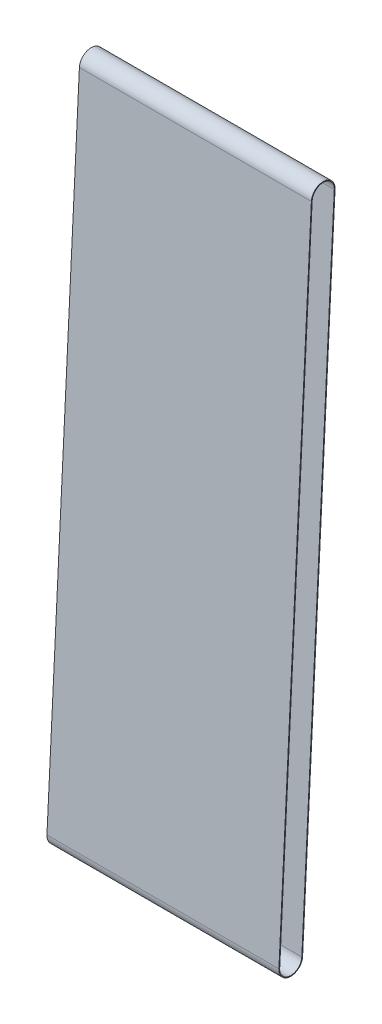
ISO-10303-21;
HEADER;
FILE_DESCRIPTION(('STEP AP214'),'2;1');
FILE_NAME('part.step','',(''),(''),'','','');
FILE_SCHEMA(('AUTOMOTIVE_DESIGN { 1 0 10303 214 1 1 1 1 }'));
ENDSEC;
DATA;
#1=APPLICATION_CONTEXT('core data for automotive mechanical design processes');
#2=APPLICATION_PROTOCOL_DEFINITION('international standard','automotive_design',2000,#1);
#3=PRODUCT_CONTEXT('',#1,'mechanical');
#4=PRODUCT('Part','Part','',(#3));
#5=PRODUCT_RELATED_PRODUCT_CATEGORY('part','',(#4));
#6=PRODUCT_DEFINITION_FORMATION('','',#4);
#7=PRODUCT_DEFINITION_CONTEXT('part definition',#1,'design');
#8=PRODUCT_DEFINITION('design','',#6,#7);
#9=PRODUCT_DEFINITION_SHAPE('','',#8);
#10=(LENGTH_UNIT() NAMED_UNIT(*) SI_UNIT(.MILLI.,.METRE.));
#11=(NAMED_UNIT(*) PLANE_ANGLE_UNIT() SI_UNIT($,.RADIAN.));
#12=(NAMED_UNIT(*) SI_UNIT($,.STERADIAN.) SOLID_ANGLE_UNIT());
#13=UNCERTAINTY_MEASURE_WITH_UNIT(LENGTH_MEASURE(1.E-05),#10,'distance_accuracy_value','');
#14=(GEOMETRIC_REPRESENTATION_CONTEXT(3) GLOBAL_UNCERTAINTY_ASSIGNED_CONTEXT((#13)) GLOBAL_UNIT_ASSIGNED_CONTEXT((#10,
#11,#12)) REPRESENTATION_CONTEXT('',''));
#15=CARTESIAN_POINT('',(0.,0.,0.));
#16=DIRECTION('',(0.,0.,1.));
#17=DIRECTION('',(1.,0.,0.));
#18=AXIS2_PLACEMENT_3D('',#15,#16,#17);
#19=CARTESIAN_POINT('',(0.,0.,0.));
#20=DIRECTION('',(1.,0.,0.));
#21=DIRECTION('',(0.,0.,-1.));
#22=AXIS2_PLACEMENT_3D('',#19,#20,#21);
#23=CYLINDRICAL_SURFACE('',#22,22.5);
#24=DIRECTION('',(1.,0.,0.));
#25=VECTOR('',#24,1.);
#26=CARTESIAN_POINT('',(0.,-1.12497718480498,-22.471858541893));
#27=LINE('',#26,#25);
#28=CARTESIAN_POINT('',(-220.,-1.12497718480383,-22.4718585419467));
#29=VERTEX_POINT('',#28);
#30=CARTESIAN_POINT('',(220.,-1.12497718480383,-22.4718585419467));
#31=VERTEX_POINT('',#30);
#32=EDGE_CURVE('E83',#29,#31,#27,.T.);
#33=ORIENTED_EDGE('',*,*,#32,.T.);
#34=CARTESIAN_POINT('',(220.,0.,0.));
#35=DIRECTION('',(1.,0.,0.));
#36=DIRECTION('',(0.,0.,-1.));
#37=AXIS2_PLACEMENT_3D('',#34,#35,#36);
#38=CIRCLE('',#37,22.5);
#39=CARTESIAN_POINT('',(220.,1.12497718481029,22.4718585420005));
#40=VERTEX_POINT('',#39);
#41=EDGE_CURVE('E125',#40,#31,#38,.T.);
#42=ORIENTED_EDGE('',*,*,#41,.F.);
#43=DIRECTION('',(1.,0.,0.));
#44=VECTOR('',#43,1.);
#45=CARTESIAN_POINT('',(0.,1.12497718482,22.471858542));
#46=LINE('',#45,#44);
#47=CARTESIAN_POINT('',(-220.,1.12497718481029,22.4718585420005));
#48=VERTEX_POINT('',#47);
#49=EDGE_CURVE('E79',#40,#48,#46,.F.);
#50=ORIENTED_EDGE('',*,*,#49,.T.);
#51=CARTESIAN_POINT('',(-220.,0.,0.));
#52=DIRECTION('',(1.,0.,0.));
#53=DIRECTION('',(0.,0.,-1.));
#54=AXIS2_PLACEMENT_3D('',#51,#52,#53);
#55=CIRCLE('',#54,22.5);
#56=EDGE_CURVE('E19',#48,#29,#55,.T.);
#57=ORIENTED_EDGE('',*,*,#56,.T.);
#58=EDGE_LOOP('',(#33,#42,#50,#57));
#59=FACE_BOUND('',#58,.T.);
#60=ADVANCED_FACE('F16',(#59),#23,.T.);
#61=CARTESIAN_POINT('',(0.,1228.83474702,-84.0456097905));
#62=DIRECTION('',(0.,0.0499989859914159,0.998749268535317));
#63=DIRECTION('',(0.,-0.998749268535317,0.0499989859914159));
#64=AXIS2_PLACEMENT_3D('',#61,#62,#63);
#65=PLANE('',#64);
#66=ORIENTED_EDGE('',*,*,#32,.F.);
#67=DIRECTION('',(0.,0.998749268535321,-0.049998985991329));
#68=VECTOR('',#67,1.);
#69=CARTESIAN_POINT('',(-220.,-1.12497718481,-22.471858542));
#70=LINE('',#69,#68);
#71=CARTESIAN_POINT('',(-220.,1228.8347470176,-84.0456097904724));
#72=VERTEX_POINT('',#71);
#73=EDGE_CURVE('E88',#29,#72,#70,.T.);
#74=ORIENTED_EDGE('',*,*,#73,.T.);
#75=DIRECTION('',(1.,0.,0.));
#76=VECTOR('',#75,1.);
#77=CARTESIAN_POINT('',(0.,1228.83474701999,-84.0456097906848));
#78=LINE('',#77,#76);
#79=CARTESIAN_POINT('',(220.,1228.8347470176,-84.0456097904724));
#80=VERTEX_POINT('',#79);
#81=EDGE_CURVE('E96',#80,#72,#78,.F.);
#82=ORIENTED_EDGE('',*,*,#81,.F.);
#83=DIRECTION('',(0.,0.998749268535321,-0.049998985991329));
#84=VECTOR('',#83,1.);
#85=CARTESIAN_POINT('',(220.,-1.12497718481,-22.471858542));
#86=LINE('',#85,#84);
#87=EDGE_CURVE('E94',#31,#80,#86,.T.);
#88=ORIENTED_EDGE('',*,*,#87,.F.);
#89=EDGE_LOOP('',(#66,#74,#82,#88));
#90=FACE_BOUND('',#89,.T.);
#91=ADVANCED_FACE('F91',(#90),#65,.F.);
#92=CARTESIAN_POINT('',(0.,1229.9597242,-61.5737512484));
#93=DIRECTION('',(1.,0.,0.));
#94=DIRECTION('',(0.,0.,-1.));
#95=AXIS2_PLACEMENT_3D('',#92,#93,#94);
#96=CYLINDRICAL_SURFACE('',#95,22.5);
#97=DIRECTION('',(1.,0.,0.));
#98=VECTOR('',#97,1.);
#99=CARTESIAN_POINT('',(0.,1231.08470138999,-39.1018927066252));
#100=LINE('',#99,#98);
#101=CARTESIAN_POINT('',(-220.,1231.0847013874,-39.1018927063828));
#102=VERTEX_POINT('',#101);
#103=CARTESIAN_POINT('',(220.,1231.0847013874,-39.1018927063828));
#104=VERTEX_POINT('',#103);
#105=EDGE_CURVE('E111',#102,#104,#100,.T.);
#106=ORIENTED_EDGE('',*,*,#105,.T.);
#107=CARTESIAN_POINT('',(220.,1229.9597242,-61.5737512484));
#108=DIRECTION('',(1.,0.,0.));
#109=DIRECTION('',(0.,0.,-1.));
#110=AXIS2_PLACEMENT_3D('',#107,#108,#109);
#111=CIRCLE('',#110,22.5);
#112=EDGE_CURVE('E121',#80,#104,#111,.T.);
#113=ORIENTED_EDGE('',*,*,#112,.F.);
#114=ORIENTED_EDGE('',*,*,#81,.T.);
#115=CARTESIAN_POINT('',(-220.,1229.9597242,-61.5737512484));
#116=DIRECTION('',(1.,0.,0.));
#117=DIRECTION('',(0.,0.,-1.));
#118=AXIS2_PLACEMENT_3D('',#115,#116,#117);
#119=CIRCLE('',#118,22.5);
#120=EDGE_CURVE('E100',#72,#102,#119,.T.);
#121=ORIENTED_EDGE('',*,*,#120,.T.);
#122=EDGE_LOOP('',(#106,#113,#114,#121));
#123=FACE_BOUND('',#122,.T.);
#124=ADVANCED_FACE('F220',(#123),#96,.T.);
#125=CARTESIAN_POINT('',(0.,1.12497718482,22.471858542));
#126=DIRECTION('',(0.,-0.0499989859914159,-0.998749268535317));
#127=DIRECTION('',(0.,0.998749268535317,-0.0499989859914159));
#128=AXIS2_PLACEMENT_3D('',#125,#126,#127);
#129=PLANE('',#128);
#130=ORIENTED_EDGE('',*,*,#105,.F.);
#131=DIRECTION('',(0.,-0.998749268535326,0.049998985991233));
#132=VECTOR('',#131,1.);
#133=CARTESIAN_POINT('',(-220.,1231.08470139,-39.1018927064));
#134=LINE('',#133,#132);
#135=EDGE_CURVE('E102',#102,#48,#134,.T.);
#136=ORIENTED_EDGE('',*,*,#135,.T.);
#137=ORIENTED_EDGE('',*,*,#49,.F.);
#138=DIRECTION('',(0.,-0.998749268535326,0.049998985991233));
#139=VECTOR('',#138,1.);
#140=CARTESIAN_POINT('',(220.,1231.08470139,-39.1018927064));
#141=LINE('',#140,#139);
#142=EDGE_CURVE('E124',#104,#40,#141,.T.);
#143=ORIENTED_EDGE('',*,*,#142,.F.);
#144=EDGE_LOOP('',(#130,#136,#137,#143));
#145=FACE_BOUND('',#144,.T.);
#146=ADVANCED_FACE('F166',(#145),#129,.F.);
#147=CARTESIAN_POINT('',(0.,1.04997870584,20.9737346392));
#148=DIRECTION('',(0.,-0.0499989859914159,-0.998749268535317));
#149=DIRECTION('',(0.,0.998749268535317,-0.0499989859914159));
#150=AXIS2_PLACEMENT_3D('',#147,#148,#149);
#151=PLANE('',#150);
#152=DIRECTION('',(1.,0.,0.));
#153=VECTOR('',#152,1.);
#154=CARTESIAN_POINT('',(0.,1231.00970290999,-40.6000166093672));
#155=LINE('',#154,#153);
#156=CARTESIAN_POINT('',(-220.,1231.00970290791,-40.6000166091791));
#157=VERTEX_POINT('',#156);
#158=CARTESIAN_POINT('',(220.,1231.00970290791,-40.6000166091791));
#159=VERTEX_POINT('',#158);
#160=EDGE_CURVE('E89',#157,#159,#155,.T.);
#161=ORIENTED_EDGE('',*,*,#160,.T.);
#162=DIRECTION('',(0.,0.998749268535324,-0.0499989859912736));
#163=VECTOR('',#162,1.);
#164=CARTESIAN_POINT('',(220.,1.04997870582,20.9737346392));
#165=LINE('',#164,#163);
#166=CARTESIAN_POINT('',(220.,1.04997870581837,20.9737346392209));
#167=VERTEX_POINT('',#166);
#168=EDGE_CURVE('E120',#167,#159,#165,.T.);
#169=ORIENTED_EDGE('',*,*,#168,.F.);
#170=DIRECTION('',(1.,0.,0.));
#171=VECTOR('',#170,1.);
#172=CARTESIAN_POINT('',(0.,1.04997870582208,20.9737346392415));
#173=LINE('',#172,#171);
#174=CARTESIAN_POINT('',(-220.,1.04997870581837,20.9737346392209));
#175=VERTEX_POINT('',#174);
#176=EDGE_CURVE('E106',#167,#175,#173,.F.);
#177=ORIENTED_EDGE('',*,*,#176,.T.);
#178=DIRECTION('',(0.,0.998749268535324,-0.0499989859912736));
#179=VECTOR('',#178,1.);
#180=CARTESIAN_POINT('',(-220.,1.04997870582,20.9737346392));
#181=LINE('',#180,#179);
#182=EDGE_CURVE('E128',#175,#157,#181,.T.);
#183=ORIENTED_EDGE('',*,*,#182,.T.);
#184=EDGE_LOOP('',(#161,#169,#177,#183));
#185=FACE_BOUND('',#184,.T.);
#186=ADVANCED_FACE('F151',(#185),#151,.T.);
#187=CARTESIAN_POINT('',(0.,1229.9597242,-61.5737512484));
#188=DIRECTION('',(1.,0.,0.));
#189=DIRECTION('',(0.,0.,-1.));
#190=AXIS2_PLACEMENT_3D('',#187,#188,#189);
#191=CYLINDRICAL_SURFACE('',#190,21.);
#192=ORIENTED_EDGE('',*,*,#160,.F.);
#193=CARTESIAN_POINT('',(-220.,1229.9597242,-61.5737512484));
#194=DIRECTION('',(1.,0.,0.));
#195=DIRECTION('',(0.,0.,-1.));
#196=AXIS2_PLACEMENT_3D('',#193,#194,#195);
#197=CIRCLE('',#196,21.);
#198=CARTESIAN_POINT('',(-220.,1228.9097454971,-82.5474858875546));
#199=VERTEX_POINT('',#198);
#200=EDGE_CURVE('E109',#157,#199,#197,.F.);
#201=ORIENTED_EDGE('',*,*,#200,.T.);
#202=DIRECTION('',(1.,0.,0.));
#203=VECTOR('',#202,1.);
#204=CARTESIAN_POINT('',(0.,1228.9097455,-82.5474858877));
#205=LINE('',#204,#203);
#206=CARTESIAN_POINT('',(220.,1228.9097454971,-82.5474858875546));
#207=VERTEX_POINT('',#206);
#208=EDGE_CURVE('E116',#207,#199,#205,.F.);
#209=ORIENTED_EDGE('',*,*,#208,.F.);
#210=CARTESIAN_POINT('',(220.,1229.9597242,-61.5737512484));
#211=DIRECTION('',(1.,0.,0.));
#212=DIRECTION('',(0.,0.,-1.));
#213=AXIS2_PLACEMENT_3D('',#210,#211,#212);
#214=CIRCLE('',#213,21.);
#215=EDGE_CURVE('E117',#159,#207,#214,.F.);
#216=ORIENTED_EDGE('',*,*,#215,.F.);
#217=EDGE_LOOP('',(#192,#201,#209,#216));
#218=FACE_BOUND('',#217,.T.);
#219=ADVANCED_FACE('F157',(#218),#191,.F.);
#220=CARTESIAN_POINT('',(-220.,0.,0.));
#221=DIRECTION('',(1.,0.,0.));
#222=DIRECTION('',(0.,0.,-1.));
#223=AXIS2_PLACEMENT_3D('',#220,#221,#222);
#224=PLANE('',#223);
#225=DIRECTION('',(0.,-0.998749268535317,0.0499989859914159));
#226=VECTOR('',#225,1.);
#227=CARTESIAN_POINT('',(-220.,1228.9097455,-82.5474858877));
#228=LINE('',#227,#226);
#229=CARTESIAN_POINT('',(-220.,-1.04997870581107,-20.9737346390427));
#230=VERTEX_POINT('',#229);
#231=EDGE_CURVE('E136',#199,#230,#228,.T.);
#232=ORIENTED_EDGE('',*,*,#231,.F.);
#233=ORIENTED_EDGE('',*,*,#200,.F.);
#234=ORIENTED_EDGE('',*,*,#182,.F.);
#235=CARTESIAN_POINT('',(-220.,0.,0.));
#236=DIRECTION('',(1.,0.,0.));
#237=DIRECTION('',(0.,0.,-1.));
#238=AXIS2_PLACEMENT_3D('',#235,#236,#237);
#239=CIRCLE('',#238,21.);
#240=EDGE_CURVE('E108',#175,#230,#239,.T.);
#241=ORIENTED_EDGE('',*,*,#240,.T.);
#242=EDGE_LOOP('',(#232,#233,#234,#241));
#243=FACE_BOUND('',#242,.T.);
#244=ORIENTED_EDGE('',*,*,#120,.F.);
#245=ORIENTED_EDGE('',*,*,#73,.F.);
#246=ORIENTED_EDGE('',*,*,#56,.F.);
#247=ORIENTED_EDGE('',*,*,#135,.F.);
#248=EDGE_LOOP('',(#244,#245,#246,#247));
#249=FACE_BOUND('',#248,.T.);
#250=ADVANCED_FACE('F99',(#243,#249),#224,.F.);
#251=CARTESIAN_POINT('',(0.,0.,0.));
#252=DIRECTION('',(1.,0.,0.));
#253=DIRECTION('',(0.,0.,-1.));
#254=AXIS2_PLACEMENT_3D('',#251,#252,#253);
#255=CYLINDRICAL_SURFACE('',#254,21.);
#256=DIRECTION('',(1.,0.,0.));
#257=VECTOR('',#256,1.);
#258=CARTESIAN_POINT('',(0.,-1.04997870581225,-20.9737346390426));
#259=LINE('',#258,#257);
#260=CARTESIAN_POINT('',(220.,-1.04997870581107,-20.9737346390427));
#261=VERTEX_POINT('',#260);
#262=EDGE_CURVE('E25',#230,#261,#259,.T.);
#263=ORIENTED_EDGE('',*,*,#262,.F.);
#264=ORIENTED_EDGE('',*,*,#240,.F.);
#265=ORIENTED_EDGE('',*,*,#176,.F.);
#266=CARTESIAN_POINT('',(220.,0.,0.));
#267=DIRECTION('',(1.,0.,0.));
#268=DIRECTION('',(0.,0.,-1.));
#269=AXIS2_PLACEMENT_3D('',#266,#267,#268);
#270=CIRCLE('',#269,21.);
#271=EDGE_CURVE('E34',#261,#167,#270,.F.);
#272=ORIENTED_EDGE('',*,*,#271,.F.);
#273=EDGE_LOOP('',(#263,#264,#265,#272));
#274=FACE_BOUND('',#273,.T.);
#275=ADVANCED_FACE('F153',(#274),#255,.F.);
#276=CARTESIAN_POINT('',(220.,0.,0.));
#277=DIRECTION('',(1.,0.,0.));
#278=DIRECTION('',(0.,0.,-1.));
#279=AXIS2_PLACEMENT_3D('',#276,#277,#278);
#280=PLANE('',#279);
#281=DIRECTION('',(0.,-0.998749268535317,0.0499989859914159));
#282=VECTOR('',#281,1.);
#283=CARTESIAN_POINT('',(220.,1228.9097455,-82.5474858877));
#284=LINE('',#283,#282);
#285=EDGE_CURVE('E11',#261,#207,#284,.F.);
#286=ORIENTED_EDGE('',*,*,#285,.F.);
#287=ORIENTED_EDGE('',*,*,#271,.T.);
#288=ORIENTED_EDGE('',*,*,#168,.T.);
#289=ORIENTED_EDGE('',*,*,#215,.T.);
#290=EDGE_LOOP('',(#286,#287,#288,#289));
#291=FACE_BOUND('',#290,.T.);
#292=ORIENTED_EDGE('',*,*,#112,.T.);
#293=ORIENTED_EDGE('',*,*,#142,.T.);
#294=ORIENTED_EDGE('',*,*,#41,.T.);
#295=ORIENTED_EDGE('',*,*,#87,.T.);
#296=EDGE_LOOP('',(#292,#293,#294,#295));
#297=FACE_BOUND('',#296,.T.);
#298=ADVANCED_FACE('F148',(#291,#297),#280,.T.);
#299=CARTESIAN_POINT('',(0.,1228.9097455,-82.5474858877));
#300=DIRECTION('',(0.,0.0499989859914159,0.998749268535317));
#301=DIRECTION('',(0.,-0.998749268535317,0.0499989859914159));
#302=AXIS2_PLACEMENT_3D('',#299,#300,#301);
#303=PLANE('',#302);
#304=ORIENTED_EDGE('',*,*,#262,.T.);
#305=ORIENTED_EDGE('',*,*,#285,.T.);
#306=ORIENTED_EDGE('',*,*,#208,.T.);
#307=ORIENTED_EDGE('',*,*,#231,.T.);
#308=EDGE_LOOP('',(#304,#305,#306,#307));
#309=FACE_BOUND('',#308,.T.);
#310=ADVANCED_FACE('F156',(#309),#303,.T.);
#311=CLOSED_SHELL('',(#60,#91,#124,#146,#186,#219,#250,#275,#298,#310));
#312=MANIFOLD_SOLID_BREP('B1',#311);
#313=ADVANCED_BREP_SHAPE_REPRESENTATION('',(#18,#312),#14);
#314=SHAPE_DEFINITION_REPRESENTATION(#9,#313);
ENDSEC;
END-ISO-10303-21;
